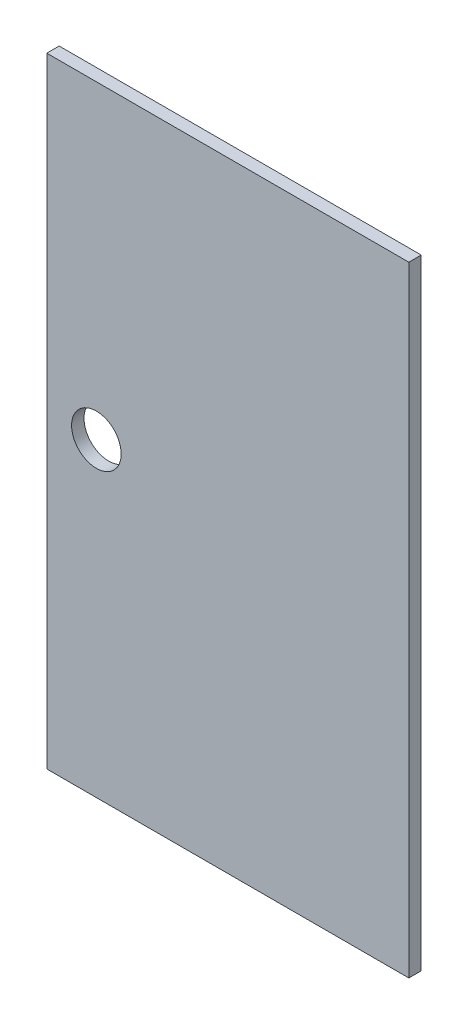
from build123d import *

# Parameters (mm, degrees)
SKETCH1_W           = 292
SKETCH1_H           = 10
BOSS_EXTRUDE1_DEPTH = 500
SKETCH2_R           = 20
CUT_EXTRUDE1_DEPTH  = 271


with BuildPart() as part:
    # Sketch1 → Boss-Extrude1 (new body)
    with BuildSketch(Plane(origin=(0, 0, 0), x_dir=(1, 0, 0), z_dir=(0, 1, 0))):
        Rectangle(SKETCH1_W, SKETCH1_H)
    extrude(amount=BOSS_EXTRUDE1_DEPTH)

    # Sketch2 → Cut-Extrude1 (cut)
    with BuildSketch(Plane.XY.offset(5)):
        with Locations((-106, 250)):
            Circle(SKETCH2_R)
    extrude(amount=-CUT_EXTRUDE1_DEPTH, mode=Mode.SUBTRACT)


solid = part.part
